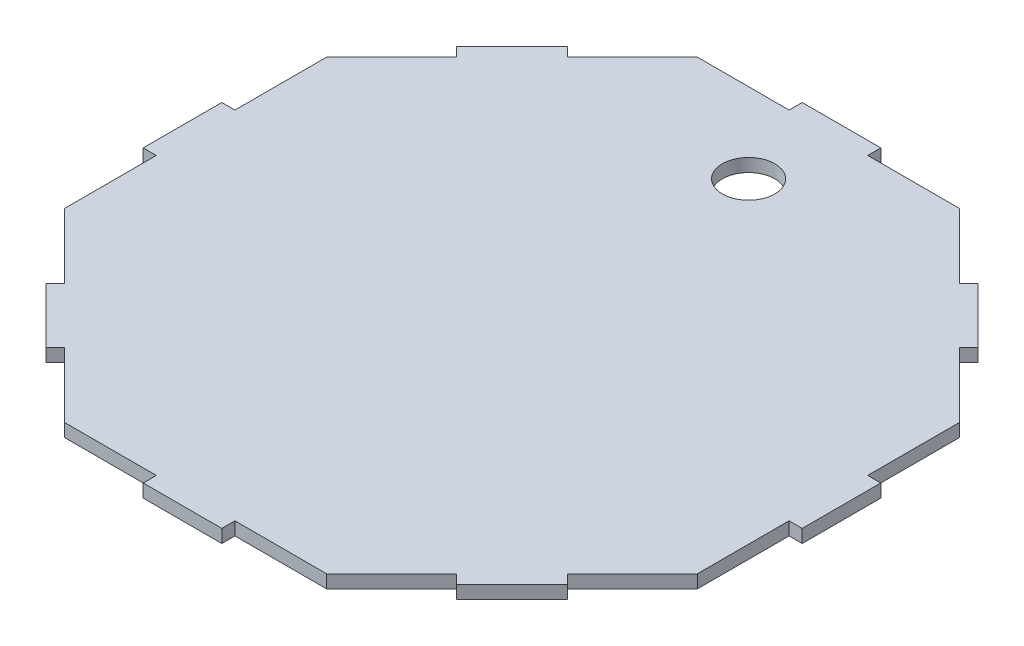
ISO-10303-21;
HEADER;
FILE_DESCRIPTION(('STEP AP214'),'2;1');
FILE_NAME('part.step','',(''),(''),'','','');
FILE_SCHEMA(('AUTOMOTIVE_DESIGN { 1 0 10303 214 1 1 1 1 }'));
ENDSEC;
DATA;
#1=APPLICATION_CONTEXT('core data for automotive mechanical design processes');
#2=APPLICATION_PROTOCOL_DEFINITION('international standard','automotive_design',2000,#1);
#3=PRODUCT_CONTEXT('',#1,'mechanical');
#4=PRODUCT('Part','Part','',(#3));
#5=PRODUCT_RELATED_PRODUCT_CATEGORY('part','',(#4));
#6=PRODUCT_DEFINITION_FORMATION('','',#4);
#7=PRODUCT_DEFINITION_CONTEXT('part definition',#1,'design');
#8=PRODUCT_DEFINITION('design','',#6,#7);
#9=PRODUCT_DEFINITION_SHAPE('','',#8);
#10=(LENGTH_UNIT() NAMED_UNIT(*) SI_UNIT(.MILLI.,.METRE.));
#11=(NAMED_UNIT(*) PLANE_ANGLE_UNIT() SI_UNIT($,.RADIAN.));
#12=(NAMED_UNIT(*) SI_UNIT($,.STERADIAN.) SOLID_ANGLE_UNIT());
#13=UNCERTAINTY_MEASURE_WITH_UNIT(LENGTH_MEASURE(1.E-05),#10,'distance_accuracy_value','');
#14=(GEOMETRIC_REPRESENTATION_CONTEXT(3) GLOBAL_UNCERTAINTY_ASSIGNED_CONTEXT((#13)) GLOBAL_UNIT_ASSIGNED_CONTEXT((#10,
#11,#12)) REPRESENTATION_CONTEXT('',''));
#15=CARTESIAN_POINT('',(0.,0.,0.));
#16=DIRECTION('',(0.,0.,1.));
#17=DIRECTION('',(1.,0.,0.));
#18=AXIS2_PLACEMENT_3D('',#15,#16,#17);
#19=CARTESIAN_POINT('',(104.801696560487,5.,8.72649424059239E-13));
#20=DIRECTION('',(1.,0.,0.));
#21=DIRECTION('',(0.,0.,-1.));
#22=AXIS2_PLACEMENT_3D('',#19,#20,#21);
#23=PLANE('',#22);
#24=DIRECTION('',(0.,0.,1.));
#25=VECTOR('',#24,1.);
#26=CARTESIAN_POINT('',(104.801696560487,0.,8.72649424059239E-13));
#27=LINE('',#26,#25);
#28=CARTESIAN_POINT('',(104.801696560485,0.,156.372402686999));
#29=VERTEX_POINT('',#28);
#30=CARTESIAN_POINT('',(104.801696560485,0.,161.372402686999));
#31=VERTEX_POINT('',#30);
#32=EDGE_CURVE('E324',#29,#31,#27,.T.);
#33=ORIENTED_EDGE('',*,*,#32,.F.);
#34=DIRECTION('',(0.,-1.,0.));
#35=VECTOR('',#34,1.);
#36=CARTESIAN_POINT('',(104.801696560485,5.,156.372402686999));
#37=LINE('',#36,#35);
#38=CARTESIAN_POINT('',(104.801696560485,5.,156.372402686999));
#39=VERTEX_POINT('',#38);
#40=EDGE_CURVE('E11',#39,#29,#37,.T.);
#41=ORIENTED_EDGE('',*,*,#40,.F.);
#42=DIRECTION('',(0.,0.,1.));
#43=VECTOR('',#42,1.);
#44=CARTESIAN_POINT('',(104.801696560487,5.,8.72649424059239E-13));
#45=LINE('',#44,#43);
#46=CARTESIAN_POINT('',(104.801696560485,5.,161.372402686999));
#47=VERTEX_POINT('',#46);
#48=EDGE_CURVE('E538',#39,#47,#45,.T.);
#49=ORIENTED_EDGE('',*,*,#48,.T.);
#50=DIRECTION('',(0.,-1.,0.));
#51=VECTOR('',#50,1.);
#52=CARTESIAN_POINT('',(104.801696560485,5.,161.372402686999));
#53=LINE('',#52,#51);
#54=EDGE_CURVE('E52',#47,#31,#53,.T.);
#55=ORIENTED_EDGE('',*,*,#54,.T.);
#56=EDGE_LOOP('',(#33,#41,#49,#55));
#57=FACE_BOUND('',#56,.T.);
#58=ADVANCED_FACE('F35',(#57),#23,.T.);
#59=CARTESIAN_POINT('',(7.44035322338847E-13,5.,156.372402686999));
#60=DIRECTION('',(0.,0.,1.));
#61=DIRECTION('',(1.,0.,0.));
#62=AXIS2_PLACEMENT_3D('',#59,#60,#61);
#63=PLANE('',#62);
#64=DIRECTION('',(-1.,0.,0.));
#65=VECTOR('',#64,1.);
#66=CARTESIAN_POINT('',(7.44035322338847E-13,0.,156.372402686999));
#67=LINE('',#66,#65);
#68=CARTESIAN_POINT('',(139.801696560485,0.,156.372402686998));
#69=VERTEX_POINT('',#68);
#70=EDGE_CURVE('E326',#69,#29,#67,.T.);
#71=ORIENTED_EDGE('',*,*,#70,.F.);
#72=DIRECTION('',(0.,-1.,0.));
#73=VECTOR('',#72,1.);
#74=CARTESIAN_POINT('',(139.801696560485,5.,156.372402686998));
#75=LINE('',#74,#73);
#76=CARTESIAN_POINT('',(139.801696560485,5.,156.372402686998));
#77=VERTEX_POINT('',#76);
#78=EDGE_CURVE('E44',#77,#69,#75,.T.);
#79=ORIENTED_EDGE('',*,*,#78,.F.);
#80=DIRECTION('',(-1.,0.,0.));
#81=VECTOR('',#80,1.);
#82=CARTESIAN_POINT('',(7.44035322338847E-13,5.,156.372402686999));
#83=LINE('',#82,#81);
#84=EDGE_CURVE('E536',#77,#39,#83,.T.);
#85=ORIENTED_EDGE('',*,*,#84,.T.);
#86=ORIENTED_EDGE('',*,*,#40,.T.);
#87=EDGE_LOOP('',(#71,#79,#85,#86));
#88=FACE_BOUND('',#87,.T.);
#89=ADVANCED_FACE('F521',(#88),#63,.T.);
#90=CARTESIAN_POINT('',(148.087049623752,5.,148.087049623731));
#91=DIRECTION('',(0.707106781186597,0.,0.707106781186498));
#92=DIRECTION('',(0.707106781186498,0.,-0.707106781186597));
#93=AXIS2_PLACEMENT_3D('',#90,#91,#92);
#94=PLANE('',#93);
#95=DIRECTION('',(-0.707106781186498,0.,0.707106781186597));
#96=VECTOR('',#95,1.);
#97=CARTESIAN_POINT('',(148.087049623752,0.,148.087049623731));
#98=LINE('',#97,#96);
#99=CARTESIAN_POINT('',(164.550433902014,0.,131.623665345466));
#100=VERTEX_POINT('',#99);
#101=EDGE_CURVE('E329',#100,#69,#98,.T.);
#102=ORIENTED_EDGE('',*,*,#101,.F.);
#103=DIRECTION('',(0.,-1.,0.));
#104=VECTOR('',#103,1.);
#105=CARTESIAN_POINT('',(164.550433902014,5.,131.623665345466));
#106=LINE('',#105,#104);
#107=CARTESIAN_POINT('',(164.550433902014,5.,131.623665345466));
#108=VERTEX_POINT('',#107);
#109=EDGE_CURVE('E510',#108,#100,#106,.T.);
#110=ORIENTED_EDGE('',*,*,#109,.F.);
#111=DIRECTION('',(-0.707106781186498,0.,0.707106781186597));
#112=VECTOR('',#111,1.);
#113=CARTESIAN_POINT('',(148.087049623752,5.,148.087049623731));
#114=LINE('',#113,#112);
#115=EDGE_CURVE('E517',#108,#77,#114,.T.);
#116=ORIENTED_EDGE('',*,*,#115,.T.);
#117=ORIENTED_EDGE('',*,*,#78,.T.);
#118=EDGE_LOOP('',(#102,#110,#116,#117));
#119=FACE_BOUND('',#118,.T.);
#120=ADVANCED_FACE('F515',(#119),#94,.T.);
#121=CARTESIAN_POINT('',(16.46338427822,5.,-16.4633842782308));
#122=DIRECTION('',(0.707106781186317,0.,-0.707106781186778));
#123=DIRECTION('',(-0.707106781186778,0.,-0.707106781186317));
#124=AXIS2_PLACEMENT_3D('',#121,#122,#123);
#125=PLANE('',#124);
#126=DIRECTION('',(0.707106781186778,0.,0.707106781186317));
#127=VECTOR('',#126,1.);
#128=CARTESIAN_POINT('',(16.46338427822,0.,-16.4633842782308));
#129=LINE('',#128,#127);
#130=CARTESIAN_POINT('',(168.085967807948,0.,135.159199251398));
#131=VERTEX_POINT('',#130);
#132=EDGE_CURVE('E332',#100,#131,#129,.T.);
#133=ORIENTED_EDGE('',*,*,#132,.T.);
#134=DIRECTION('',(0.,-1.,0.));
#135=VECTOR('',#134,1.);
#136=CARTESIAN_POINT('',(168.085967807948,5.,135.159199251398));
#137=LINE('',#136,#135);
#138=CARTESIAN_POINT('',(168.085967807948,5.,135.159199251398));
#139=VERTEX_POINT('',#138);
#140=EDGE_CURVE('E508',#139,#131,#137,.T.);
#141=ORIENTED_EDGE('',*,*,#140,.F.);
#142=DIRECTION('',(0.707106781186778,0.,0.707106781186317));
#143=VECTOR('',#142,1.);
#144=CARTESIAN_POINT('',(16.46338427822,5.,-16.4633842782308));
#145=LINE('',#144,#143);
#146=EDGE_CURVE('E532',#108,#139,#145,.T.);
#147=ORIENTED_EDGE('',*,*,#146,.F.);
#148=ORIENTED_EDGE('',*,*,#109,.T.);
#149=EDGE_LOOP('',(#133,#141,#147,#148));
#150=FACE_BOUND('',#149,.T.);
#151=ADVANCED_FACE('F529',(#150),#125,.F.);
#152=CARTESIAN_POINT('',(151.622583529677,5.,151.622583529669));
#153=DIRECTION('',(0.707106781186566,0.,0.707106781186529));
#154=DIRECTION('',(0.707106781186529,0.,-0.707106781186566));
#155=AXIS2_PLACEMENT_3D('',#152,#153,#154);
#156=PLANE('',#155);
#157=DIRECTION('',(-0.707106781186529,0.,0.707106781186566));
#158=VECTOR('',#157,1.);
#159=CARTESIAN_POINT('',(151.622583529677,0.,151.622583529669));
#160=LINE('',#159,#158);
#161=CARTESIAN_POINT('',(189.299171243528,0.,113.945995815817));
#162=VERTEX_POINT('',#161);
#163=EDGE_CURVE('E335',#162,#131,#160,.T.);
#164=ORIENTED_EDGE('',*,*,#163,.F.);
#165=DIRECTION('',(0.,-1.,0.));
#166=VECTOR('',#165,1.);
#167=CARTESIAN_POINT('',(189.299171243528,5.,113.945995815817));
#168=LINE('',#167,#166);
#169=CARTESIAN_POINT('',(189.299171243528,5.,113.945995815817));
#170=VERTEX_POINT('',#169);
#171=EDGE_CURVE('E506',#170,#162,#168,.T.);
#172=ORIENTED_EDGE('',*,*,#171,.F.);
#173=DIRECTION('',(-0.707106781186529,0.,0.707106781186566));
#174=VECTOR('',#173,1.);
#175=CARTESIAN_POINT('',(151.622583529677,5.,151.622583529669));
#176=LINE('',#175,#174);
#177=EDGE_CURVE('E534',#170,#139,#176,.T.);
#178=ORIENTED_EDGE('',*,*,#177,.T.);
#179=ORIENTED_EDGE('',*,*,#140,.T.);
#180=EDGE_LOOP('',(#164,#172,#178,#179));
#181=FACE_BOUND('',#180,.T.);
#182=ADVANCED_FACE('F654',(#181),#156,.T.);
#183=CARTESIAN_POINT('',(37.6765877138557,5.,-37.6765877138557));
#184=DIRECTION('',(-0.707106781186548,0.,0.707106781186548));
#185=DIRECTION('',(0.707106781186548,0.,0.707106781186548));
#186=AXIS2_PLACEMENT_3D('',#183,#184,#185);
#187=PLANE('',#186);
#188=DIRECTION('',(-0.707106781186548,0.,-0.707106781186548));
#189=VECTOR('',#188,1.);
#190=CARTESIAN_POINT('',(37.6765877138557,0.,-37.6765877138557));
#191=LINE('',#190,#189);
#192=CARTESIAN_POINT('',(185.763637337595,0.,110.410461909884));
#193=VERTEX_POINT('',#192);
#194=EDGE_CURVE('E338',#162,#193,#191,.T.);
#195=ORIENTED_EDGE('',*,*,#194,.T.);
#196=DIRECTION('',(0.,-1.,0.));
#197=VECTOR('',#196,1.);
#198=CARTESIAN_POINT('',(185.763637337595,5.,110.410461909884));
#199=LINE('',#198,#197);
#200=CARTESIAN_POINT('',(185.763637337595,5.,110.410461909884));
#201=VERTEX_POINT('',#200);
#202=EDGE_CURVE('E504',#201,#193,#199,.T.);
#203=ORIENTED_EDGE('',*,*,#202,.F.);
#204=DIRECTION('',(-0.707106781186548,0.,-0.707106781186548));
#205=VECTOR('',#204,1.);
#206=CARTESIAN_POINT('',(37.6765877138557,5.,-37.6765877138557));
#207=LINE('',#206,#205);
#208=EDGE_CURVE('E543',#170,#201,#207,.T.);
#209=ORIENTED_EDGE('',*,*,#208,.F.);
#210=ORIENTED_EDGE('',*,*,#171,.T.);
#211=EDGE_LOOP('',(#195,#203,#209,#210));
#212=FACE_BOUND('',#211,.T.);
#213=ADVANCED_FACE('F657',(#212),#187,.F.);
#214=CARTESIAN_POINT('',(148.087049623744,5.,148.087049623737));
#215=DIRECTION('',(0.707106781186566,0.,0.707106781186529));
#216=DIRECTION('',(0.707106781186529,0.,-0.707106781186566));
#217=AXIS2_PLACEMENT_3D('',#214,#215,#216);
#218=PLANE('',#217);
#219=DIRECTION('',(-0.707106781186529,0.,0.707106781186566));
#220=VECTOR('',#219,1.);
#221=CARTESIAN_POINT('',(148.087049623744,0.,148.087049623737));
#222=LINE('',#221,#220);
#223=CARTESIAN_POINT('',(210.512374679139,0.,85.6617245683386));
#224=VERTEX_POINT('',#223);
#225=EDGE_CURVE('E341',#224,#193,#222,.T.);
#226=ORIENTED_EDGE('',*,*,#225,.F.);
#227=DIRECTION('',(0.,-1.,0.));
#228=VECTOR('',#227,1.);
#229=CARTESIAN_POINT('',(210.512374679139,5.,85.6617245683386));
#230=LINE('',#229,#228);
#231=CARTESIAN_POINT('',(210.512374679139,5.,85.6617245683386));
#232=VERTEX_POINT('',#231);
#233=EDGE_CURVE('E502',#232,#224,#230,.T.);
#234=ORIENTED_EDGE('',*,*,#233,.F.);
#235=DIRECTION('',(-0.707106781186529,0.,0.707106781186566));
#236=VECTOR('',#235,1.);
#237=CARTESIAN_POINT('',(148.087049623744,5.,148.087049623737));
#238=LINE('',#237,#236);
#239=EDGE_CURVE('E545',#232,#201,#238,.T.);
#240=ORIENTED_EDGE('',*,*,#239,.T.);
#241=ORIENTED_EDGE('',*,*,#202,.T.);
#242=EDGE_LOOP('',(#226,#234,#240,#241));
#243=FACE_BOUND('',#242,.T.);
#244=ADVANCED_FACE('F661',(#243),#218,.T.);
#245=CARTESIAN_POINT('',(210.51237467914,5.,2.00327730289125E-12));
#246=DIRECTION('',(1.,0.,0.));
#247=DIRECTION('',(0.,0.,-1.));
#248=AXIS2_PLACEMENT_3D('',#245,#246,#247);
#249=PLANE('',#248);
#250=DIRECTION('',(0.,0.,1.));
#251=VECTOR('',#250,1.);
#252=CARTESIAN_POINT('',(210.51237467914,0.,2.00327730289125E-12));
#253=LINE('',#252,#251);
#254=CARTESIAN_POINT('',(210.512374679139,0.,50.6617245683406));
#255=VERTEX_POINT('',#254);
#256=EDGE_CURVE('E344',#255,#224,#253,.T.);
#257=ORIENTED_EDGE('',*,*,#256,.F.);
#258=DIRECTION('',(0.,-1.,0.));
#259=VECTOR('',#258,1.);
#260=CARTESIAN_POINT('',(210.512374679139,5.,50.6617245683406));
#261=LINE('',#260,#259);
#262=CARTESIAN_POINT('',(210.512374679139,5.,50.6617245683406));
#263=VERTEX_POINT('',#262);
#264=EDGE_CURVE('E500',#263,#255,#261,.T.);
#265=ORIENTED_EDGE('',*,*,#264,.F.);
#266=DIRECTION('',(0.,0.,1.));
#267=VECTOR('',#266,1.);
#268=CARTESIAN_POINT('',(210.51237467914,5.,2.00327730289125E-12));
#269=LINE('',#268,#267);
#270=EDGE_CURVE('E548',#263,#232,#269,.T.);
#271=ORIENTED_EDGE('',*,*,#270,.T.);
#272=ORIENTED_EDGE('',*,*,#233,.T.);
#273=EDGE_LOOP('',(#257,#265,#271,#272));
#274=FACE_BOUND('',#273,.T.);
#275=ADVANCED_FACE('F665',(#274),#249,.T.);
#276=CARTESIAN_POINT('',(1.01945536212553E-11,5.,50.661724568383));
#277=DIRECTION('',(-2.01227923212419E-13,0.,-1.));
#278=DIRECTION('',(-1.,0.,2.01227923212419E-13));
#279=AXIS2_PLACEMENT_3D('',#276,#277,#278);
#280=PLANE('',#279);
#281=DIRECTION('',(1.,0.,-2.01227923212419E-13));
#282=VECTOR('',#281,1.);
#283=CARTESIAN_POINT('',(1.01945536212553E-11,0.,50.661724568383));
#284=LINE('',#283,#282);
#285=CARTESIAN_POINT('',(215.512374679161,0.,50.6617245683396));
#286=VERTEX_POINT('',#285);
#287=EDGE_CURVE('E347',#255,#286,#284,.T.);
#288=ORIENTED_EDGE('',*,*,#287,.T.);
#289=DIRECTION('',(0.,-1.,0.));
#290=VECTOR('',#289,1.);
#291=CARTESIAN_POINT('',(215.512374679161,5.,50.6617245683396));
#292=LINE('',#291,#290);
#293=CARTESIAN_POINT('',(215.512374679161,5.,50.6617245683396));
#294=VERTEX_POINT('',#293);
#295=EDGE_CURVE('E498',#294,#286,#292,.T.);
#296=ORIENTED_EDGE('',*,*,#295,.F.);
#297=DIRECTION('',(1.,0.,-2.01227923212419E-13));
#298=VECTOR('',#297,1.);
#299=CARTESIAN_POINT('',(1.01945536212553E-11,5.,50.661724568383));
#300=LINE('',#299,#298);
#301=EDGE_CURVE('E551',#263,#294,#300,.T.);
#302=ORIENTED_EDGE('',*,*,#301,.F.);
#303=ORIENTED_EDGE('',*,*,#264,.T.);
#304=EDGE_LOOP('',(#288,#296,#302,#303));
#305=FACE_BOUND('',#304,.T.);
#306=ADVANCED_FACE('F669',(#305),#280,.F.);
#307=CARTESIAN_POINT('',(215.512374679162,5.,1.99389000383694E-12));
#308=DIRECTION('',(1.,0.,0.));
#309=DIRECTION('',(0.,0.,-1.));
#310=AXIS2_PLACEMENT_3D('',#307,#308,#309);
#311=PLANE('',#310);
#312=DIRECTION('',(0.,0.,1.));
#313=VECTOR('',#312,1.);
#314=CARTESIAN_POINT('',(215.512374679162,0.,1.99389000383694E-12));
#315=LINE('',#314,#313);
#316=CARTESIAN_POINT('',(215.512374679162,0.,20.6617245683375));
#317=VERTEX_POINT('',#316);
#318=EDGE_CURVE('E350',#317,#286,#315,.T.);
#319=ORIENTED_EDGE('',*,*,#318,.F.);
#320=DIRECTION('',(0.,-1.,0.));
#321=VECTOR('',#320,1.);
#322=CARTESIAN_POINT('',(215.512374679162,5.,20.6617245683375));
#323=LINE('',#322,#321);
#324=CARTESIAN_POINT('',(215.512374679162,5.,20.6617245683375));
#325=VERTEX_POINT('',#324);
#326=EDGE_CURVE('E496',#325,#317,#323,.T.);
#327=ORIENTED_EDGE('',*,*,#326,.F.);
#328=DIRECTION('',(0.,0.,1.));
#329=VECTOR('',#328,1.);
#330=CARTESIAN_POINT('',(215.512374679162,5.,1.99389000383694E-12));
#331=LINE('',#330,#329);
#332=EDGE_CURVE('E553',#325,#294,#331,.T.);
#333=ORIENTED_EDGE('',*,*,#332,.T.);
#334=ORIENTED_EDGE('',*,*,#295,.T.);
#335=EDGE_LOOP('',(#319,#327,#333,#334));
#336=FACE_BOUND('',#335,.T.);
#337=ADVANCED_FACE('F673',(#336),#311,.T.);
#338=CARTESIAN_POINT('',(4.18638982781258E-12,5.,20.6617245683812));
#339=DIRECTION('',(-2.02615701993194E-13,0.,-1.));
#340=DIRECTION('',(-1.,0.,2.02615701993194E-13));
#341=AXIS2_PLACEMENT_3D('',#338,#339,#340);
#342=PLANE('',#341);
#343=DIRECTION('',(1.,0.,-2.02615701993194E-13));
#344=VECTOR('',#343,1.);
#345=CARTESIAN_POINT('',(4.18638982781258E-12,0.,20.6617245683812));
#346=LINE('',#345,#344);
#347=CARTESIAN_POINT('',(210.51237467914,0.,20.6617245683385));
#348=VERTEX_POINT('',#347);
#349=EDGE_CURVE('E353',#348,#317,#346,.T.);
#350=ORIENTED_EDGE('',*,*,#349,.F.);
#351=DIRECTION('',(0.,-1.,0.));
#352=VECTOR('',#351,1.);
#353=CARTESIAN_POINT('',(210.51237467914,5.,20.6617245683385));
#354=LINE('',#353,#352);
#355=CARTESIAN_POINT('',(210.51237467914,5.,20.6617245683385));
#356=VERTEX_POINT('',#355);
#357=EDGE_CURVE('E494',#356,#348,#354,.T.);
#358=ORIENTED_EDGE('',*,*,#357,.F.);
#359=DIRECTION('',(1.,0.,-2.02615701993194E-13));
#360=VECTOR('',#359,1.);
#361=CARTESIAN_POINT('',(4.18638982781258E-12,5.,20.6617245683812));
#362=LINE('',#361,#360);
#363=EDGE_CURVE('E556',#356,#325,#362,.T.);
#364=ORIENTED_EDGE('',*,*,#363,.T.);
#365=ORIENTED_EDGE('',*,*,#326,.T.);
#366=EDGE_LOOP('',(#350,#358,#364,#365));
#367=FACE_BOUND('',#366,.T.);
#368=ADVANCED_FACE('F677',(#367),#342,.T.);
#369=CARTESIAN_POINT('',(210.51237467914,5.,8.68086831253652E-12));
#370=DIRECTION('',(1.,0.,0.));
#371=DIRECTION('',(0.,0.,-1.));
#372=AXIS2_PLACEMENT_3D('',#369,#370,#371);
#373=PLANE('',#372);
#374=DIRECTION('',(0.,0.,1.));
#375=VECTOR('',#374,1.);
#376=CARTESIAN_POINT('',(210.51237467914,0.,8.68086831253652E-12));
#377=LINE('',#376,#375);
#378=CARTESIAN_POINT('',(210.512374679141,0.,-14.3382754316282));
#379=VERTEX_POINT('',#378);
#380=EDGE_CURVE('E356',#379,#348,#377,.T.);
#381=ORIENTED_EDGE('',*,*,#380,.F.);
#382=DIRECTION('',(0.,-1.,0.));
#383=VECTOR('',#382,1.);
#384=CARTESIAN_POINT('',(210.512374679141,5.,-14.3382754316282));
#385=LINE('',#384,#383);
#386=CARTESIAN_POINT('',(210.512374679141,5.,-14.3382754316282));
#387=VERTEX_POINT('',#386);
#388=EDGE_CURVE('E492',#387,#379,#385,.T.);
#389=ORIENTED_EDGE('',*,*,#388,.F.);
#390=DIRECTION('',(0.,0.,1.));
#391=VECTOR('',#390,1.);
#392=CARTESIAN_POINT('',(210.51237467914,5.,8.68086831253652E-12));
#393=LINE('',#392,#391);
#394=EDGE_CURVE('E559',#387,#356,#393,.T.);
#395=ORIENTED_EDGE('',*,*,#394,.T.);
#396=ORIENTED_EDGE('',*,*,#357,.T.);
#397=EDGE_LOOP('',(#381,#389,#395,#396));
#398=FACE_BOUND('',#397,.T.);
#399=ADVANCED_FACE('F681',(#398),#373,.T.);
#400=CARTESIAN_POINT('',(112.425325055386,5.,-112.425325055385));
#401=DIRECTION('',(0.707106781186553,0.,-0.707106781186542));
#402=DIRECTION('',(-0.707106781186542,0.,-0.707106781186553));
#403=AXIS2_PLACEMENT_3D('',#400,#401,#402);
#404=PLANE('',#403);
#405=DIRECTION('',(0.707106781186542,0.,0.707106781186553));
#406=VECTOR('',#405,1.);
#407=CARTESIAN_POINT('',(112.425325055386,0.,-112.425325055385));
#408=LINE('',#407,#406);
#409=CARTESIAN_POINT('',(185.763637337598,0.,-39.0870127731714));
#410=VERTEX_POINT('',#409);
#411=EDGE_CURVE('E359',#410,#379,#408,.T.);
#412=ORIENTED_EDGE('',*,*,#411,.F.);
#413=DIRECTION('',(0.,-1.,0.));
#414=VECTOR('',#413,1.);
#415=CARTESIAN_POINT('',(185.763637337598,5.,-39.0870127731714));
#416=LINE('',#415,#414);
#417=CARTESIAN_POINT('',(185.763637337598,5.,-39.0870127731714));
#418=VERTEX_POINT('',#417);
#419=EDGE_CURVE('E490',#418,#410,#416,.T.);
#420=ORIENTED_EDGE('',*,*,#419,.F.);
#421=DIRECTION('',(0.707106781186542,0.,0.707106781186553));
#422=VECTOR('',#421,1.);
#423=CARTESIAN_POINT('',(112.425325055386,5.,-112.425325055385));
#424=LINE('',#423,#422);
#425=EDGE_CURVE('E562',#418,#387,#424,.T.);
#426=ORIENTED_EDGE('',*,*,#425,.T.);
#427=ORIENTED_EDGE('',*,*,#388,.T.);
#428=EDGE_LOOP('',(#412,#420,#426,#427));
#429=FACE_BOUND('',#428,.T.);
#430=ADVANCED_FACE('F685',(#429),#404,.T.);
#431=CARTESIAN_POINT('',(73.3383122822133,5.,73.3383122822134));
#432=DIRECTION('',(0.707106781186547,0.,0.707106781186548));
#433=DIRECTION('',(0.707106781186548,0.,-0.707106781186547));
#434=AXIS2_PLACEMENT_3D('',#431,#432,#433);
#435=PLANE('',#434);
#436=DIRECTION('',(-0.707106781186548,0.,0.707106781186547));
#437=VECTOR('',#436,1.);
#438=CARTESIAN_POINT('',(73.3383122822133,0.,73.3383122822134));
#439=LINE('',#438,#437);
#440=CARTESIAN_POINT('',(189.299171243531,0.,-42.6225466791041));
#441=VERTEX_POINT('',#440);
#442=EDGE_CURVE('E362',#441,#410,#439,.T.);
#443=ORIENTED_EDGE('',*,*,#442,.F.);
#444=DIRECTION('',(0.,-1.,0.));
#445=VECTOR('',#444,1.);
#446=CARTESIAN_POINT('',(189.299171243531,5.,-42.6225466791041));
#447=LINE('',#446,#445);
#448=CARTESIAN_POINT('',(189.299171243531,5.,-42.6225466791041));
#449=VERTEX_POINT('',#448);
#450=EDGE_CURVE('E488',#449,#441,#447,.T.);
#451=ORIENTED_EDGE('',*,*,#450,.F.);
#452=DIRECTION('',(-0.707106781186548,0.,0.707106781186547));
#453=VECTOR('',#452,1.);
#454=CARTESIAN_POINT('',(73.3383122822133,5.,73.3383122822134));
#455=LINE('',#454,#453);
#456=EDGE_CURVE('E565',#449,#418,#455,.T.);
#457=ORIENTED_EDGE('',*,*,#456,.T.);
#458=ORIENTED_EDGE('',*,*,#419,.T.);
#459=EDGE_LOOP('',(#443,#451,#457,#458));
#460=FACE_BOUND('',#459,.T.);
#461=ADVANCED_FACE('F689',(#460),#435,.T.);
#462=CARTESIAN_POINT('',(115.960858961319,5.,-115.960858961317));
#463=DIRECTION('',(0.707106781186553,0.,-0.707106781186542));
#464=DIRECTION('',(-0.707106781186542,0.,-0.707106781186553));
#465=AXIS2_PLACEMENT_3D('',#462,#463,#464);
#466=PLANE('',#465);
#467=DIRECTION('',(0.707106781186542,0.,0.707106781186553));
#468=VECTOR('',#467,1.);
#469=CARTESIAN_POINT('',(115.960858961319,0.,-115.960858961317));
#470=LINE('',#469,#468);
#471=CARTESIAN_POINT('',(168.085967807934,0.,-63.8357501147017));
#472=VERTEX_POINT('',#471);
#473=EDGE_CURVE('E365',#472,#441,#470,.T.);
#474=ORIENTED_EDGE('',*,*,#473,.F.);
#475=DIRECTION('',(0.,-1.,0.));
#476=VECTOR('',#475,1.);
#477=CARTESIAN_POINT('',(168.085967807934,5.,-63.8357501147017));
#478=LINE('',#477,#476);
#479=CARTESIAN_POINT('',(168.085967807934,5.,-63.8357501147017));
#480=VERTEX_POINT('',#479);
#481=EDGE_CURVE('E486',#480,#472,#478,.T.);
#482=ORIENTED_EDGE('',*,*,#481,.F.);
#483=DIRECTION('',(0.707106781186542,0.,0.707106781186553));
#484=VECTOR('',#483,1.);
#485=CARTESIAN_POINT('',(115.960858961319,5.,-115.960858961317));
#486=LINE('',#485,#484);
#487=EDGE_CURVE('E568',#480,#449,#486,.T.);
#488=ORIENTED_EDGE('',*,*,#487,.T.);
#489=ORIENTED_EDGE('',*,*,#450,.T.);
#490=EDGE_LOOP('',(#474,#482,#488,#489));
#491=FACE_BOUND('',#490,.T.);
#492=ADVANCED_FACE('F693',(#491),#466,.T.);
#493=CARTESIAN_POINT('',(52.1251088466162,5.,52.1251088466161));
#494=DIRECTION('',(0.707106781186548,0.,0.707106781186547));
#495=DIRECTION('',(0.707106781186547,0.,-0.707106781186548));
#496=AXIS2_PLACEMENT_3D('',#493,#494,#495);
#497=PLANE('',#496);
#498=DIRECTION('',(-0.707106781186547,0.,0.707106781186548));
#499=VECTOR('',#498,1.);
#500=CARTESIAN_POINT('',(52.1251088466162,0.,52.1251088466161));
#501=LINE('',#500,#499);
#502=CARTESIAN_POINT('',(164.550433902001,0.,-60.300216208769));
#503=VERTEX_POINT('',#502);
#504=EDGE_CURVE('E368',#472,#503,#501,.T.);
#505=ORIENTED_EDGE('',*,*,#504,.T.);
#506=DIRECTION('',(0.,-1.,0.));
#507=VECTOR('',#506,1.);
#508=CARTESIAN_POINT('',(164.550433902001,5.,-60.300216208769));
#509=LINE('',#508,#507);
#510=CARTESIAN_POINT('',(164.550433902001,5.,-60.300216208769));
#511=VERTEX_POINT('',#510);
#512=EDGE_CURVE('E484',#511,#503,#509,.T.);
#513=ORIENTED_EDGE('',*,*,#512,.F.);
#514=DIRECTION('',(-0.707106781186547,0.,0.707106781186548));
#515=VECTOR('',#514,1.);
#516=CARTESIAN_POINT('',(52.1251088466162,5.,52.1251088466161));
#517=LINE('',#516,#515);
#518=EDGE_CURVE('E571',#480,#511,#517,.T.);
#519=ORIENTED_EDGE('',*,*,#518,.F.);
#520=ORIENTED_EDGE('',*,*,#481,.T.);
#521=EDGE_LOOP('',(#505,#513,#519,#520));
#522=FACE_BOUND('',#521,.T.);
#523=ADVANCED_FACE('F697',(#522),#497,.F.);
#524=CARTESIAN_POINT('',(112.425325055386,5.,-112.425325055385));
#525=DIRECTION('',(0.707106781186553,0.,-0.707106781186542));
#526=DIRECTION('',(-0.707106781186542,0.,-0.707106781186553));
#527=AXIS2_PLACEMENT_3D('',#524,#525,#526);
#528=PLANE('',#527);
#529=DIRECTION('',(0.707106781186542,0.,0.707106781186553));
#530=VECTOR('',#529,1.);
#531=CARTESIAN_POINT('',(112.425325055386,0.,-112.425325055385));
#532=LINE('',#531,#530);
#533=CARTESIAN_POINT('',(139.801696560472,0.,-85.0489535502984));
#534=VERTEX_POINT('',#533);
#535=EDGE_CURVE('E371',#534,#503,#532,.T.);
#536=ORIENTED_EDGE('',*,*,#535,.F.);
#537=DIRECTION('',(0.,-1.,0.));
#538=VECTOR('',#537,1.);
#539=CARTESIAN_POINT('',(139.801696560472,5.,-85.0489535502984));
#540=LINE('',#539,#538);
#541=CARTESIAN_POINT('',(139.801696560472,5.,-85.0489535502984));
#542=VERTEX_POINT('',#541);
#543=EDGE_CURVE('E482',#542,#534,#540,.T.);
#544=ORIENTED_EDGE('',*,*,#543,.F.);
#545=DIRECTION('',(0.707106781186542,0.,0.707106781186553));
#546=VECTOR('',#545,1.);
#547=CARTESIAN_POINT('',(112.425325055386,5.,-112.425325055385));
#548=LINE('',#547,#546);
#549=EDGE_CURVE('E573',#542,#511,#548,.T.);
#550=ORIENTED_EDGE('',*,*,#549,.T.);
#551=ORIENTED_EDGE('',*,*,#512,.T.);
#552=EDGE_LOOP('',(#536,#544,#550,#551));
#553=FACE_BOUND('',#552,.T.);
#554=ADVANCED_FACE('F701',(#553),#528,.T.);
#555=CARTESIAN_POINT('',(5.05839141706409E-13,5.,-85.0489535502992));
#556=DIRECTION('',(0.,0.,-1.));
#557=DIRECTION('',(-1.,0.,0.));
#558=AXIS2_PLACEMENT_3D('',#555,#556,#557);
#559=PLANE('',#558);
#560=DIRECTION('',(1.,0.,0.));
#561=VECTOR('',#560,1.);
#562=CARTESIAN_POINT('',(5.05839141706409E-13,0.,-85.0489535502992));
#563=LINE('',#562,#561);
#564=CARTESIAN_POINT('',(104.801696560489,0.,-85.0489535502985));
#565=VERTEX_POINT('',#564);
#566=EDGE_CURVE('E374',#565,#534,#563,.T.);
#567=ORIENTED_EDGE('',*,*,#566,.F.);
#568=DIRECTION('',(0.,-1.,0.));
#569=VECTOR('',#568,1.);
#570=CARTESIAN_POINT('',(104.801696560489,5.,-85.0489535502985));
#571=LINE('',#570,#569);
#572=CARTESIAN_POINT('',(104.801696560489,5.,-85.0489535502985));
#573=VERTEX_POINT('',#572);
#574=EDGE_CURVE('E480',#573,#565,#571,.T.);
#575=ORIENTED_EDGE('',*,*,#574,.F.);
#576=DIRECTION('',(1.,0.,0.));
#577=VECTOR('',#576,1.);
#578=CARTESIAN_POINT('',(5.05839141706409E-13,5.,-85.0489535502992));
#579=LINE('',#578,#577);
#580=EDGE_CURVE('E576',#573,#542,#579,.T.);
#581=ORIENTED_EDGE('',*,*,#580,.T.);
#582=ORIENTED_EDGE('',*,*,#543,.T.);
#583=EDGE_LOOP('',(#567,#575,#581,#582));
#584=FACE_BOUND('',#583,.T.);
#585=ADVANCED_FACE('F705',(#584),#559,.T.);
#586=CARTESIAN_POINT('',(104.801696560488,5.,5.81766282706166E-13));
#587=DIRECTION('',(1.,0.,0.));
#588=DIRECTION('',(0.,0.,-1.));
#589=AXIS2_PLACEMENT_3D('',#586,#587,#588);
#590=PLANE('',#589);
#591=DIRECTION('',(0.,0.,1.));
#592=VECTOR('',#591,1.);
#593=CARTESIAN_POINT('',(104.801696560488,0.,5.81766282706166E-13));
#594=LINE('',#593,#592);
#595=CARTESIAN_POINT('',(104.801696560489,0.,-90.0489535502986));
#596=VERTEX_POINT('',#595);
#597=EDGE_CURVE('E377',#596,#565,#594,.T.);
#598=ORIENTED_EDGE('',*,*,#597,.F.);
#599=DIRECTION('',(0.,-1.,0.));
#600=VECTOR('',#599,1.);
#601=CARTESIAN_POINT('',(104.801696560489,5.,-90.0489535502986));
#602=LINE('',#601,#600);
#603=CARTESIAN_POINT('',(104.801696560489,5.,-90.0489535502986));
#604=VERTEX_POINT('',#603);
#605=EDGE_CURVE('E478',#604,#596,#602,.T.);
#606=ORIENTED_EDGE('',*,*,#605,.F.);
#607=DIRECTION('',(0.,0.,1.));
#608=VECTOR('',#607,1.);
#609=CARTESIAN_POINT('',(104.801696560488,5.,5.81766282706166E-13));
#610=LINE('',#609,#608);
#611=EDGE_CURVE('E579',#604,#573,#610,.T.);
#612=ORIENTED_EDGE('',*,*,#611,.T.);
#613=ORIENTED_EDGE('',*,*,#574,.T.);
#614=EDGE_LOOP('',(#598,#606,#612,#613));
#615=FACE_BOUND('',#614,.T.);
#616=ADVANCED_FACE('F709',(#615),#590,.T.);
#617=CARTESIAN_POINT('',(4.58216098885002E-13,5.,-90.0489535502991));
#618=DIRECTION('',(0.,0.,-1.));
#619=DIRECTION('',(-1.,0.,0.));
#620=AXIS2_PLACEMENT_3D('',#617,#618,#619);
#621=PLANE('',#620);
#622=DIRECTION('',(1.,0.,0.));
#623=VECTOR('',#622,1.);
#624=CARTESIAN_POINT('',(4.58216098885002E-13,0.,-90.0489535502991));
#625=LINE('',#624,#623);
#626=CARTESIAN_POINT('',(74.8016965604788,0.,-90.0489535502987));
#627=VERTEX_POINT('',#626);
#628=EDGE_CURVE('E380',#627,#596,#625,.T.);
#629=ORIENTED_EDGE('',*,*,#628,.F.);
#630=DIRECTION('',(0.,-1.,0.));
#631=VECTOR('',#630,1.);
#632=CARTESIAN_POINT('',(74.8016965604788,5.,-90.0489535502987));
#633=LINE('',#632,#631);
#634=CARTESIAN_POINT('',(74.8016965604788,5.,-90.0489535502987));
#635=VERTEX_POINT('',#634);
#636=EDGE_CURVE('E476',#635,#627,#633,.T.);
#637=ORIENTED_EDGE('',*,*,#636,.F.);
#638=DIRECTION('',(1.,0.,0.));
#639=VECTOR('',#638,1.);
#640=CARTESIAN_POINT('',(4.58216098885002E-13,5.,-90.0489535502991));
#641=LINE('',#640,#639);
#642=EDGE_CURVE('E582',#635,#604,#641,.T.);
#643=ORIENTED_EDGE('',*,*,#642,.T.);
#644=ORIENTED_EDGE('',*,*,#605,.T.);
#645=EDGE_LOOP('',(#629,#637,#643,#644));
#646=FACE_BOUND('',#645,.T.);
#647=ADVANCED_FACE('F713',(#646),#621,.T.);
#648=CARTESIAN_POINT('',(74.801696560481,5.,-1.86854773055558E-12));
#649=DIRECTION('',(-1.,0.,0.));
#650=DIRECTION('',(0.,0.,1.));
#651=AXIS2_PLACEMENT_3D('',#648,#649,#650);
#652=PLANE('',#651);
#653=DIRECTION('',(0.,0.,-1.));
#654=VECTOR('',#653,1.);
#655=CARTESIAN_POINT('',(74.801696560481,0.,-1.86854773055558E-12));
#656=LINE('',#655,#654);
#657=CARTESIAN_POINT('',(74.8016965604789,0.,-85.0489535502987));
#658=VERTEX_POINT('',#657);
#659=EDGE_CURVE('E383',#658,#627,#656,.T.);
#660=ORIENTED_EDGE('',*,*,#659,.F.);
#661=DIRECTION('',(0.,-1.,0.));
#662=VECTOR('',#661,1.);
#663=CARTESIAN_POINT('',(74.8016965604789,5.,-85.0489535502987));
#664=LINE('',#663,#662);
#665=CARTESIAN_POINT('',(74.8016965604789,5.,-85.0489535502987));
#666=VERTEX_POINT('',#665);
#667=EDGE_CURVE('E474',#666,#658,#664,.T.);
#668=ORIENTED_EDGE('',*,*,#667,.F.);
#669=DIRECTION('',(0.,0.,-1.));
#670=VECTOR('',#669,1.);
#671=CARTESIAN_POINT('',(74.801696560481,5.,-1.86854773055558E-12));
#672=LINE('',#671,#670);
#673=EDGE_CURVE('E585',#666,#635,#672,.T.);
#674=ORIENTED_EDGE('',*,*,#673,.T.);
#675=ORIENTED_EDGE('',*,*,#636,.T.);
#676=EDGE_LOOP('',(#660,#668,#674,#675));
#677=FACE_BOUND('',#676,.T.);
#678=ADVANCED_FACE('F717',(#677),#652,.T.);
#679=CARTESIAN_POINT('',(4.38393922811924E-13,5.,-85.0489535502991));
#680=DIRECTION('',(0.,0.,-1.));
#681=DIRECTION('',(-1.,0.,0.));
#682=AXIS2_PLACEMENT_3D('',#679,#680,#681);
#683=PLANE('',#682);
#684=DIRECTION('',(1.,0.,0.));
#685=VECTOR('',#684,1.);
#686=CARTESIAN_POINT('',(4.38393922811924E-13,0.,-85.0489535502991));
#687=LINE('',#686,#685);
#688=CARTESIAN_POINT('',(39.801696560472,0.,-85.0489535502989));
#689=VERTEX_POINT('',#688);
#690=EDGE_CURVE('E386',#689,#658,#687,.T.);
#691=ORIENTED_EDGE('',*,*,#690,.F.);
#692=DIRECTION('',(0.,-1.,0.));
#693=VECTOR('',#692,1.);
#694=CARTESIAN_POINT('',(39.801696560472,5.,-85.0489535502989));
#695=LINE('',#694,#693);
#696=CARTESIAN_POINT('',(39.801696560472,5.,-85.0489535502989));
#697=VERTEX_POINT('',#696);
#698=EDGE_CURVE('E472',#697,#689,#695,.T.);
#699=ORIENTED_EDGE('',*,*,#698,.F.);
#700=DIRECTION('',(1.,0.,0.));
#701=VECTOR('',#700,1.);
#702=CARTESIAN_POINT('',(4.38393922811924E-13,5.,-85.0489535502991));
#703=LINE('',#702,#701);
#704=EDGE_CURVE('E588',#697,#666,#703,.T.);
#705=ORIENTED_EDGE('',*,*,#704,.T.);
#706=ORIENTED_EDGE('',*,*,#667,.T.);
#707=EDGE_LOOP('',(#691,#699,#705,#706));
#708=FACE_BOUND('',#707,.T.);
#709=ADVANCED_FACE('F721',(#708),#683,.T.);
#710=CARTESIAN_POINT('',(-22.6236284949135,5.,-22.6236284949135));
#711=DIRECTION('',(-0.707106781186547,0.,-0.707106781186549));
#712=DIRECTION('',(-0.707106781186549,0.,0.707106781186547));
#713=AXIS2_PLACEMENT_3D('',#710,#711,#712);
#714=PLANE('',#713);
#715=DIRECTION('',(0.707106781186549,0.,-0.707106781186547));
#716=VECTOR('',#715,1.);
#717=CARTESIAN_POINT('',(-22.6236284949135,0.,-22.6236284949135));
#718=LINE('',#717,#716);
#719=CARTESIAN_POINT('',(15.0529592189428,0.,-60.3002162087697));
#720=VERTEX_POINT('',#719);
#721=EDGE_CURVE('E389',#720,#689,#718,.T.);
#722=ORIENTED_EDGE('',*,*,#721,.F.);
#723=DIRECTION('',(0.,-1.,0.));
#724=VECTOR('',#723,1.);
#725=CARTESIAN_POINT('',(15.0529592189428,5.,-60.3002162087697));
#726=LINE('',#725,#724);
#727=CARTESIAN_POINT('',(15.0529592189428,5.,-60.3002162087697));
#728=VERTEX_POINT('',#727);
#729=EDGE_CURVE('E470',#728,#720,#726,.T.);
#730=ORIENTED_EDGE('',*,*,#729,.F.);
#731=DIRECTION('',(0.707106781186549,0.,-0.707106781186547));
#732=VECTOR('',#731,1.);
#733=CARTESIAN_POINT('',(-22.6236284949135,5.,-22.6236284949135));
#734=LINE('',#733,#732);
#735=EDGE_CURVE('E591',#728,#697,#734,.T.);
#736=ORIENTED_EDGE('',*,*,#735,.T.);
#737=ORIENTED_EDGE('',*,*,#698,.T.);
#738=EDGE_LOOP('',(#722,#730,#736,#737));
#739=FACE_BOUND('',#738,.T.);
#740=ADVANCED_FACE('F725',(#739),#714,.T.);
#741=CARTESIAN_POINT('',(37.6765877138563,5.,-37.676587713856));
#742=DIRECTION('',(-0.70710678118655,0.,0.707106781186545));
#743=DIRECTION('',(0.707106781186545,0.,0.70710678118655));
#744=AXIS2_PLACEMENT_3D('',#741,#742,#743);
#745=PLANE('',#744);
#746=DIRECTION('',(-0.707106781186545,0.,-0.70710678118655));
#747=VECTOR('',#746,1.);
#748=CARTESIAN_POINT('',(37.6765877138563,0.,-37.676587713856));
#749=LINE('',#748,#747);
#750=CARTESIAN_POINT('',(11.5174253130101,0.,-63.8357501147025));
#751=VERTEX_POINT('',#750);
#752=EDGE_CURVE('E392',#720,#751,#749,.T.);
#753=ORIENTED_EDGE('',*,*,#752,.T.);
#754=DIRECTION('',(0.,-1.,0.));
#755=VECTOR('',#754,1.);
#756=CARTESIAN_POINT('',(11.5174253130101,5.,-63.8357501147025));
#757=LINE('',#756,#755);
#758=CARTESIAN_POINT('',(11.5174253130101,5.,-63.8357501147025));
#759=VERTEX_POINT('',#758);
#760=EDGE_CURVE('E468',#759,#751,#757,.T.);
#761=ORIENTED_EDGE('',*,*,#760,.F.);
#762=DIRECTION('',(-0.707106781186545,0.,-0.70710678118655));
#763=VECTOR('',#762,1.);
#764=CARTESIAN_POINT('',(37.6765877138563,5.,-37.676587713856));
#765=LINE('',#764,#763);
#766=EDGE_CURVE('E594',#728,#759,#765,.T.);
#767=ORIENTED_EDGE('',*,*,#766,.F.);
#768=ORIENTED_EDGE('',*,*,#729,.T.);
#769=EDGE_LOOP('',(#753,#761,#767,#768));
#770=FACE_BOUND('',#769,.T.);
#771=ADVANCED_FACE('F729',(#770),#745,.F.);
#772=CARTESIAN_POINT('',(-26.1591624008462,5.,-26.1591624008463));
#773=DIRECTION('',(-0.707106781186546,0.,-0.707106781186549));
#774=DIRECTION('',(-0.707106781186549,0.,0.707106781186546));
#775=AXIS2_PLACEMENT_3D('',#772,#773,#774);
#776=PLANE('',#775);
#777=DIRECTION('',(0.707106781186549,0.,-0.707106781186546));
#778=VECTOR('',#777,1.);
#779=CARTESIAN_POINT('',(-26.1591624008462,0.,-26.1591624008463));
#780=LINE('',#779,#778);
#781=CARTESIAN_POINT('',(-9.69577812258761,0.,-42.6225466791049));
#782=VERTEX_POINT('',#781);
#783=EDGE_CURVE('E395',#782,#751,#780,.T.);
#784=ORIENTED_EDGE('',*,*,#783,.F.);
#785=DIRECTION('',(0.,-1.,0.));
#786=VECTOR('',#785,1.);
#787=CARTESIAN_POINT('',(-9.69577812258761,5.,-42.6225466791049));
#788=LINE('',#787,#786);
#789=CARTESIAN_POINT('',(-9.69577812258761,5.,-42.6225466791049));
#790=VERTEX_POINT('',#789);
#791=EDGE_CURVE('E466',#790,#782,#788,.T.);
#792=ORIENTED_EDGE('',*,*,#791,.F.);
#793=DIRECTION('',(0.707106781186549,0.,-0.707106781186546));
#794=VECTOR('',#793,1.);
#795=CARTESIAN_POINT('',(-26.1591624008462,5.,-26.1591624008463));
#796=LINE('',#795,#794);
#797=EDGE_CURVE('E596',#790,#759,#796,.T.);
#798=ORIENTED_EDGE('',*,*,#797,.T.);
#799=ORIENTED_EDGE('',*,*,#760,.T.);
#800=EDGE_LOOP('',(#784,#792,#798,#799));
#801=FACE_BOUND('',#800,.T.);
#802=ADVANCED_FACE('F733',(#801),#776,.T.);
#803=CARTESIAN_POINT('',(16.4633842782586,5.,-16.4633842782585));
#804=DIRECTION('',(0.70710678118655,0.,-0.707106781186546));
#805=DIRECTION('',(-0.707106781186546,0.,-0.70710678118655));
#806=AXIS2_PLACEMENT_3D('',#803,#804,#805);
#807=PLANE('',#806);
#808=DIRECTION('',(0.707106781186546,0.,0.70710678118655));
#809=VECTOR('',#808,1.);
#810=CARTESIAN_POINT('',(16.4633842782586,0.,-16.4633842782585));
#811=LINE('',#810,#809);
#812=CARTESIAN_POINT('',(-6.16024421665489,0.,-39.0870127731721));
#813=VERTEX_POINT('',#812);
#814=EDGE_CURVE('E398',#782,#813,#811,.T.);
#815=ORIENTED_EDGE('',*,*,#814,.T.);
#816=DIRECTION('',(0.,-1.,0.));
#817=VECTOR('',#816,1.);
#818=CARTESIAN_POINT('',(-6.16024421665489,5.,-39.0870127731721));
#819=LINE('',#818,#817);
#820=CARTESIAN_POINT('',(-6.16024421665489,5.,-39.0870127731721));
#821=VERTEX_POINT('',#820);
#822=EDGE_CURVE('E464',#821,#813,#819,.T.);
#823=ORIENTED_EDGE('',*,*,#822,.F.);
#824=DIRECTION('',(0.707106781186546,0.,0.70710678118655));
#825=VECTOR('',#824,1.);
#826=CARTESIAN_POINT('',(16.4633842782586,5.,-16.4633842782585));
#827=LINE('',#826,#825);
#828=EDGE_CURVE('E599',#790,#821,#827,.T.);
#829=ORIENTED_EDGE('',*,*,#828,.F.);
#830=ORIENTED_EDGE('',*,*,#791,.T.);
#831=EDGE_LOOP('',(#815,#823,#829,#830));
#832=FACE_BOUND('',#831,.T.);
#833=ADVANCED_FACE('F737',(#832),#807,.F.);
#834=CARTESIAN_POINT('',(-22.6236284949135,5.,-22.6236284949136));
#835=DIRECTION('',(-0.707106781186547,0.,-0.707106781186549));
#836=DIRECTION('',(-0.707106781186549,0.,0.707106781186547));
#837=AXIS2_PLACEMENT_3D('',#834,#835,#836);
#838=PLANE('',#837);
#839=DIRECTION('',(0.707106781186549,0.,-0.707106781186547));
#840=VECTOR('',#839,1.);
#841=CARTESIAN_POINT('',(-22.6236284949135,0.,-22.6236284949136));
#842=LINE('',#841,#840);
#843=CARTESIAN_POINT('',(-30.908981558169,0.,-14.3382754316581));
#844=VERTEX_POINT('',#843);
#845=EDGE_CURVE('E401',#844,#813,#842,.T.);
#846=ORIENTED_EDGE('',*,*,#845,.F.);
#847=DIRECTION('',(0.,-1.,0.));
#848=VECTOR('',#847,1.);
#849=CARTESIAN_POINT('',(-30.908981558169,5.,-14.3382754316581));
#850=LINE('',#849,#848);
#851=CARTESIAN_POINT('',(-30.908981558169,5.,-14.3382754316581));
#852=VERTEX_POINT('',#851);
#853=EDGE_CURVE('E462',#852,#844,#850,.T.);
#854=ORIENTED_EDGE('',*,*,#853,.F.);
#855=DIRECTION('',(0.707106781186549,0.,-0.707106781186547));
#856=VECTOR('',#855,1.);
#857=CARTESIAN_POINT('',(-22.6236284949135,5.,-22.6236284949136));
#858=LINE('',#857,#856);
#859=EDGE_CURVE('E601',#852,#821,#858,.T.);
#860=ORIENTED_EDGE('',*,*,#859,.T.);
#861=ORIENTED_EDGE('',*,*,#822,.T.);
#862=EDGE_LOOP('',(#846,#854,#860,#861));
#863=FACE_BOUND('',#862,.T.);
#864=ADVANCED_FACE('F741',(#863),#838,.T.);
#865=CARTESIAN_POINT('',(-30.9089815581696,5.,-1.33893144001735E-12));
#866=DIRECTION('',(-1.,0.,0.));
#867=DIRECTION('',(0.,0.,1.));
#868=AXIS2_PLACEMENT_3D('',#865,#866,#867);
#869=PLANE('',#868);
#870=DIRECTION('',(0.,0.,-1.));
#871=VECTOR('',#870,1.);
#872=CARTESIAN_POINT('',(-30.9089815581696,0.,-1.33893144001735E-12));
#873=LINE('',#872,#871);
#874=CARTESIAN_POINT('',(-30.9089815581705,0.,20.6617245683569));
#875=VERTEX_POINT('',#874);
#876=EDGE_CURVE('E404',#875,#844,#873,.T.);
#877=ORIENTED_EDGE('',*,*,#876,.F.);
#878=DIRECTION('',(0.,-1.,0.));
#879=VECTOR('',#878,1.);
#880=CARTESIAN_POINT('',(-30.9089815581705,5.,20.6617245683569));
#881=LINE('',#880,#879);
#882=CARTESIAN_POINT('',(-30.9089815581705,5.,20.6617245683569));
#883=VERTEX_POINT('',#882);
#884=EDGE_CURVE('E460',#883,#875,#881,.T.);
#885=ORIENTED_EDGE('',*,*,#884,.F.);
#886=DIRECTION('',(0.,0.,-1.));
#887=VECTOR('',#886,1.);
#888=CARTESIAN_POINT('',(-30.9089815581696,5.,-1.33893144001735E-12));
#889=LINE('',#888,#887);
#890=EDGE_CURVE('E604',#883,#852,#889,.T.);
#891=ORIENTED_EDGE('',*,*,#890,.T.);
#892=ORIENTED_EDGE('',*,*,#853,.T.);
#893=EDGE_LOOP('',(#877,#885,#891,#892));
#894=FACE_BOUND('',#893,.T.);
#895=ADVANCED_FACE('F745',(#894),#869,.T.);
#896=CARTESIAN_POINT('',(0.,5.,20.6617245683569));
#897=DIRECTION('',(0.,0.,-1.));
#898=DIRECTION('',(-1.,0.,0.));
#899=AXIS2_PLACEMENT_3D('',#896,#897,#898);
#900=PLANE('',#899);
#901=DIRECTION('',(1.,0.,0.));
#902=VECTOR('',#901,1.);
#903=CARTESIAN_POINT('',(0.,0.,20.6617245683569));
#904=LINE('',#903,#902);
#905=CARTESIAN_POINT('',(-35.9089815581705,0.,20.6617245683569));
#906=VERTEX_POINT('',#905);
#907=EDGE_CURVE('E407',#906,#875,#904,.T.);
#908=ORIENTED_EDGE('',*,*,#907,.F.);
#909=DIRECTION('',(0.,-1.,0.));
#910=VECTOR('',#909,1.);
#911=CARTESIAN_POINT('',(-35.9089815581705,5.,20.6617245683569));
#912=LINE('',#911,#910);
#913=CARTESIAN_POINT('',(-35.9089815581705,5.,20.6617245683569));
#914=VERTEX_POINT('',#913);
#915=EDGE_CURVE('E458',#914,#906,#912,.T.);
#916=ORIENTED_EDGE('',*,*,#915,.F.);
#917=DIRECTION('',(1.,0.,0.));
#918=VECTOR('',#917,1.);
#919=CARTESIAN_POINT('',(0.,5.,20.6617245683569));
#920=LINE('',#919,#918);
#921=EDGE_CURVE('E607',#914,#883,#920,.T.);
#922=ORIENTED_EDGE('',*,*,#921,.T.);
#923=ORIENTED_EDGE('',*,*,#884,.T.);
#924=EDGE_LOOP('',(#908,#916,#922,#923));
#925=FACE_BOUND('',#924,.T.);
#926=ADVANCED_FACE('F749',(#925),#900,.T.);
#927=CARTESIAN_POINT('',(-35.9089815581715,5.,1.80231963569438E-12));
#928=DIRECTION('',(-1.,0.,0.));
#929=DIRECTION('',(0.,0.,1.));
#930=AXIS2_PLACEMENT_3D('',#927,#928,#929);
#931=PLANE('',#930);
#932=DIRECTION('',(0.,0.,-1.));
#933=VECTOR('',#932,1.);
#934=CARTESIAN_POINT('',(-35.9089815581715,0.,1.80231963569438E-12));
#935=LINE('',#934,#933);
#936=CARTESIAN_POINT('',(-35.908981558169,0.,50.6617245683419));
#937=VERTEX_POINT('',#936);
#938=EDGE_CURVE('E410',#937,#906,#935,.T.);
#939=ORIENTED_EDGE('',*,*,#938,.F.);
#940=DIRECTION('',(0.,-1.,0.));
#941=VECTOR('',#940,1.);
#942=CARTESIAN_POINT('',(-35.908981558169,5.,50.6617245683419));
#943=LINE('',#942,#941);
#944=CARTESIAN_POINT('',(-35.908981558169,5.,50.6617245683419));
#945=VERTEX_POINT('',#944);
#946=EDGE_CURVE('E456',#945,#937,#943,.T.);
#947=ORIENTED_EDGE('',*,*,#946,.F.);
#948=DIRECTION('',(0.,0.,-1.));
#949=VECTOR('',#948,1.);
#950=CARTESIAN_POINT('',(-35.9089815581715,5.,1.80231963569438E-12));
#951=LINE('',#950,#949);
#952=EDGE_CURVE('E610',#945,#914,#951,.T.);
#953=ORIENTED_EDGE('',*,*,#952,.T.);
#954=ORIENTED_EDGE('',*,*,#915,.T.);
#955=EDGE_LOOP('',(#939,#947,#953,#954));
#956=FACE_BOUND('',#955,.T.);
#957=ADVANCED_FACE('F753',(#956),#931,.T.);
#958=CARTESIAN_POINT('',(0.,5.,50.6617245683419));
#959=DIRECTION('',(0.,0.,-1.));
#960=DIRECTION('',(-1.,0.,0.));
#961=AXIS2_PLACEMENT_3D('',#958,#959,#960);
#962=PLANE('',#961);
#963=DIRECTION('',(1.,0.,0.));
#964=VECTOR('',#963,1.);
#965=CARTESIAN_POINT('',(0.,0.,50.6617245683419));
#966=LINE('',#965,#964);
#967=CARTESIAN_POINT('',(-30.9089815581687,0.,50.6617245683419));
#968=VERTEX_POINT('',#967);
#969=EDGE_CURVE('E413',#937,#968,#966,.T.);
#970=ORIENTED_EDGE('',*,*,#969,.T.);
#971=DIRECTION('',(0.,-1.,0.));
#972=VECTOR('',#971,1.);
#973=CARTESIAN_POINT('',(-30.9089815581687,5.,50.6617245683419));
#974=LINE('',#973,#972);
#975=CARTESIAN_POINT('',(-30.9089815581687,5.,50.6617245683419));
#976=VERTEX_POINT('',#975);
#977=EDGE_CURVE('E454',#976,#968,#974,.T.);
#978=ORIENTED_EDGE('',*,*,#977,.F.);
#979=DIRECTION('',(1.,0.,0.));
#980=VECTOR('',#979,1.);
#981=CARTESIAN_POINT('',(0.,5.,50.6617245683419));
#982=LINE('',#981,#980);
#983=EDGE_CURVE('E613',#945,#976,#982,.T.);
#984=ORIENTED_EDGE('',*,*,#983,.F.);
#985=ORIENTED_EDGE('',*,*,#946,.T.);
#986=EDGE_LOOP('',(#970,#978,#984,#985));
#987=FACE_BOUND('',#986,.T.);
#988=ADVANCED_FACE('F757',(#987),#962,.F.);
#989=CARTESIAN_POINT('',(-30.9089815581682,5.,-2.78816386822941E-13));
#990=DIRECTION('',(-1.,0.,0.));
#991=DIRECTION('',(0.,0.,1.));
#992=AXIS2_PLACEMENT_3D('',#989,#990,#991);
#993=PLANE('',#992);
#994=DIRECTION('',(0.,0.,-1.));
#995=VECTOR('',#994,1.);
#996=CARTESIAN_POINT('',(-30.9089815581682,0.,-2.78816386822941E-13));
#997=LINE('',#996,#995);
#998=CARTESIAN_POINT('',(-30.908981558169,0.,85.661724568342));
#999=VERTEX_POINT('',#998);
#1000=EDGE_CURVE('E416',#999,#968,#997,.T.);
#1001=ORIENTED_EDGE('',*,*,#1000,.F.);
#1002=DIRECTION('',(0.,-1.,0.));
#1003=VECTOR('',#1002,1.);
#1004=CARTESIAN_POINT('',(-30.908981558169,5.,85.661724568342));
#1005=LINE('',#1004,#1003);
#1006=CARTESIAN_POINT('',(-30.908981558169,5.,85.661724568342));
#1007=VERTEX_POINT('',#1006);
#1008=EDGE_CURVE('E452',#1007,#999,#1005,.T.);
#1009=ORIENTED_EDGE('',*,*,#1008,.F.);
#1010=DIRECTION('',(0.,0.,-1.));
#1011=VECTOR('',#1010,1.);
#1012=CARTESIAN_POINT('',(-30.9089815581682,5.,-2.78816386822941E-13));
#1013=LINE('',#1012,#1011);
#1014=EDGE_CURVE('E615',#1007,#976,#1013,.T.);
#1015=ORIENTED_EDGE('',*,*,#1014,.T.);
#1016=ORIENTED_EDGE('',*,*,#977,.T.);
#1017=EDGE_LOOP('',(#1001,#1009,#1015,#1016));
#1018=FACE_BOUND('',#1017,.T.);
#1019=ADVANCED_FACE('F761',(#1018),#993,.T.);
#1020=CARTESIAN_POINT('',(-58.2853530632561,5.,58.2853530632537));
#1021=DIRECTION('',(-0.707106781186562,0.,0.707106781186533));
#1022=DIRECTION('',(0.707106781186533,0.,0.707106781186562));
#1023=AXIS2_PLACEMENT_3D('',#1020,#1021,#1022);
#1024=PLANE('',#1023);
#1025=DIRECTION('',(-0.707106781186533,0.,-0.707106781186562));
#1026=VECTOR('',#1025,1.);
#1027=CARTESIAN_POINT('',(-58.2853530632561,0.,58.2853530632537));
#1028=LINE('',#1027,#1026);
#1029=CARTESIAN_POINT('',(-6.16024421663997,0.,110.410461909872));
#1030=VERTEX_POINT('',#1029);
#1031=EDGE_CURVE('E419',#1030,#999,#1028,.T.);
#1032=ORIENTED_EDGE('',*,*,#1031,.F.);
#1033=DIRECTION('',(0.,-1.,0.));
#1034=VECTOR('',#1033,1.);
#1035=CARTESIAN_POINT('',(-6.16024421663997,5.,110.410461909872));
#1036=LINE('',#1035,#1034);
#1037=CARTESIAN_POINT('',(-6.16024421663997,5.,110.410461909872));
#1038=VERTEX_POINT('',#1037);
#1039=EDGE_CURVE('E450',#1038,#1030,#1036,.T.);
#1040=ORIENTED_EDGE('',*,*,#1039,.F.);
#1041=DIRECTION('',(-0.707106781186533,0.,-0.707106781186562));
#1042=VECTOR('',#1041,1.);
#1043=CARTESIAN_POINT('',(-58.2853530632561,5.,58.2853530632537));
#1044=LINE('',#1043,#1042);
#1045=EDGE_CURVE('E618',#1038,#1007,#1044,.T.);
#1046=ORIENTED_EDGE('',*,*,#1045,.T.);
#1047=ORIENTED_EDGE('',*,*,#1008,.T.);
#1048=EDGE_LOOP('',(#1032,#1040,#1046,#1047));
#1049=FACE_BOUND('',#1048,.T.);
#1050=ADVANCED_FACE('F765',(#1049),#1024,.T.);
#1051=CARTESIAN_POINT('',(52.125108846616,5.,52.1251088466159));
#1052=DIRECTION('',(0.707106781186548,0.,0.707106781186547));
#1053=DIRECTION('',(0.707106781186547,0.,-0.707106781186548));
#1054=AXIS2_PLACEMENT_3D('',#1051,#1052,#1053);
#1055=PLANE('',#1054);
#1056=DIRECTION('',(-0.707106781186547,0.,0.707106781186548));
#1057=VECTOR('',#1056,1.);
#1058=CARTESIAN_POINT('',(52.125108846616,0.,52.1251088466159));
#1059=LINE('',#1058,#1057);
#1060=CARTESIAN_POINT('',(-9.69577812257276,0.,113.945995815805));
#1061=VERTEX_POINT('',#1060);
#1062=EDGE_CURVE('E422',#1030,#1061,#1059,.T.);
#1063=ORIENTED_EDGE('',*,*,#1062,.T.);
#1064=DIRECTION('',(0.,-1.,0.));
#1065=VECTOR('',#1064,1.);
#1066=CARTESIAN_POINT('',(-9.69577812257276,5.,113.945995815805));
#1067=LINE('',#1066,#1065);
#1068=CARTESIAN_POINT('',(-9.69577812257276,5.,113.945995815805));
#1069=VERTEX_POINT('',#1068);
#1070=EDGE_CURVE('E448',#1069,#1061,#1067,.T.);
#1071=ORIENTED_EDGE('',*,*,#1070,.F.);
#1072=DIRECTION('',(-0.707106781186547,0.,0.707106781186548));
#1073=VECTOR('',#1072,1.);
#1074=CARTESIAN_POINT('',(52.125108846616,5.,52.1251088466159));
#1075=LINE('',#1074,#1073);
#1076=EDGE_CURVE('E621',#1038,#1069,#1075,.T.);
#1077=ORIENTED_EDGE('',*,*,#1076,.F.);
#1078=ORIENTED_EDGE('',*,*,#1039,.T.);
#1079=EDGE_LOOP('',(#1063,#1071,#1077,#1078));
#1080=FACE_BOUND('',#1079,.T.);
#1081=ADVANCED_FACE('F769',(#1080),#1055,.F.);
#1082=CARTESIAN_POINT('',(-61.820886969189,5.,61.8208869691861));
#1083=DIRECTION('',(-0.707106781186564,0.,0.707106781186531));
#1084=DIRECTION('',(0.707106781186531,0.,0.707106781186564));
#1085=AXIS2_PLACEMENT_3D('',#1082,#1083,#1084);
#1086=PLANE('',#1085);
#1087=DIRECTION('',(-0.707106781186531,0.,-0.707106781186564));
#1088=VECTOR('',#1087,1.);
#1089=CARTESIAN_POINT('',(-61.820886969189,0.,61.8208869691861));
#1090=LINE('',#1089,#1088);
#1091=CARTESIAN_POINT('',(11.5174253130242,0.,135.159199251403));
#1092=VERTEX_POINT('',#1091);
#1093=EDGE_CURVE('E425',#1092,#1061,#1090,.T.);
#1094=ORIENTED_EDGE('',*,*,#1093,.F.);
#1095=DIRECTION('',(0.,-1.,0.));
#1096=VECTOR('',#1095,1.);
#1097=CARTESIAN_POINT('',(11.5174253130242,5.,135.159199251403));
#1098=LINE('',#1097,#1096);
#1099=CARTESIAN_POINT('',(11.5174253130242,5.,135.159199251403));
#1100=VERTEX_POINT('',#1099);
#1101=EDGE_CURVE('E446',#1100,#1092,#1098,.T.);
#1102=ORIENTED_EDGE('',*,*,#1101,.F.);
#1103=DIRECTION('',(-0.707106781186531,0.,-0.707106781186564));
#1104=VECTOR('',#1103,1.);
#1105=CARTESIAN_POINT('',(-61.820886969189,5.,61.8208869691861));
#1106=LINE('',#1105,#1104);
#1107=EDGE_CURVE('E623',#1100,#1069,#1106,.T.);
#1108=ORIENTED_EDGE('',*,*,#1107,.T.);
#1109=ORIENTED_EDGE('',*,*,#1070,.T.);
#1110=EDGE_LOOP('',(#1094,#1102,#1108,#1109));
#1111=FACE_BOUND('',#1110,.T.);
#1112=ADVANCED_FACE('F773',(#1111),#1086,.T.);
#1113=CARTESIAN_POINT('',(73.3383122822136,5.,73.338312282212));
#1114=DIRECTION('',(0.707106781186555,0.,0.70710678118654));
#1115=DIRECTION('',(0.70710678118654,0.,-0.707106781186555));
#1116=AXIS2_PLACEMENT_3D('',#1113,#1114,#1115);
#1117=PLANE('',#1116);
#1118=DIRECTION('',(-0.70710678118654,0.,0.707106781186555));
#1119=VECTOR('',#1118,1.);
#1120=CARTESIAN_POINT('',(73.3383122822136,0.,73.338312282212));
#1121=LINE('',#1120,#1119);
#1122=CARTESIAN_POINT('',(15.052959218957,0.,131.62366534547));
#1123=VERTEX_POINT('',#1122);
#1124=EDGE_CURVE('E428',#1123,#1092,#1121,.T.);
#1125=ORIENTED_EDGE('',*,*,#1124,.F.);
#1126=DIRECTION('',(0.,-1.,0.));
#1127=VECTOR('',#1126,1.);
#1128=CARTESIAN_POINT('',(15.052959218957,5.,131.62366534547));
#1129=LINE('',#1128,#1127);
#1130=CARTESIAN_POINT('',(15.052959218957,5.,131.62366534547));
#1131=VERTEX_POINT('',#1130);
#1132=EDGE_CURVE('E444',#1131,#1123,#1129,.T.);
#1133=ORIENTED_EDGE('',*,*,#1132,.F.);
#1134=DIRECTION('',(-0.70710678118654,0.,0.707106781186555));
#1135=VECTOR('',#1134,1.);
#1136=CARTESIAN_POINT('',(73.3383122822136,5.,73.338312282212));
#1137=LINE('',#1136,#1135);
#1138=EDGE_CURVE('E626',#1131,#1100,#1137,.T.);
#1139=ORIENTED_EDGE('',*,*,#1138,.T.);
#1140=ORIENTED_EDGE('',*,*,#1101,.T.);
#1141=EDGE_LOOP('',(#1125,#1133,#1139,#1140));
#1142=FACE_BOUND('',#1141,.T.);
#1143=ADVANCED_FACE('F777',(#1142),#1117,.T.);
#1144=CARTESIAN_POINT('',(-58.2853530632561,5.,58.2853530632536));
#1145=DIRECTION('',(-0.707106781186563,0.,0.707106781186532));
#1146=DIRECTION('',(0.707106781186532,0.,0.707106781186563));
#1147=AXIS2_PLACEMENT_3D('',#1144,#1145,#1146);
#1148=PLANE('',#1147);
#1149=DIRECTION('',(-0.707106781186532,0.,-0.707106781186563));
#1150=VECTOR('',#1149,1.);
#1151=CARTESIAN_POINT('',(-58.2853530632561,0.,58.2853530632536));
#1152=LINE('',#1151,#1150);
#1153=CARTESIAN_POINT('',(39.801696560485,0.,156.372402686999));
#1154=VERTEX_POINT('',#1153);
#1155=EDGE_CURVE('E431',#1154,#1123,#1152,.T.);
#1156=ORIENTED_EDGE('',*,*,#1155,.F.);
#1157=DIRECTION('',(0.,-1.,0.));
#1158=VECTOR('',#1157,1.);
#1159=CARTESIAN_POINT('',(39.801696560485,5.,156.372402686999));
#1160=LINE('',#1159,#1158);
#1161=CARTESIAN_POINT('',(39.801696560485,5.,156.372402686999));
#1162=VERTEX_POINT('',#1161);
#1163=EDGE_CURVE('E303',#1162,#1154,#1160,.T.);
#1164=ORIENTED_EDGE('',*,*,#1163,.F.);
#1165=DIRECTION('',(-0.707106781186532,0.,-0.707106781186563));
#1166=VECTOR('',#1165,1.);
#1167=CARTESIAN_POINT('',(-58.2853530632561,5.,58.2853530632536));
#1168=LINE('',#1167,#1166);
#1169=EDGE_CURVE('E313',#1162,#1131,#1168,.T.);
#1170=ORIENTED_EDGE('',*,*,#1169,.T.);
#1171=ORIENTED_EDGE('',*,*,#1132,.T.);
#1172=EDGE_LOOP('',(#1156,#1164,#1170,#1171));
#1173=FACE_BOUND('',#1172,.T.);
#1174=ADVANCED_FACE('F630',(#1173),#1148,.T.);
#1175=CARTESIAN_POINT('',(7.44035322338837E-13,5.,156.372402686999));
#1176=DIRECTION('',(0.,0.,1.));
#1177=DIRECTION('',(1.,0.,0.));
#1178=AXIS2_PLACEMENT_3D('',#1175,#1176,#1177);
#1179=PLANE('',#1178);
#1180=DIRECTION('',(-1.,0.,0.));
#1181=VECTOR('',#1180,1.);
#1182=CARTESIAN_POINT('',(7.44035322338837E-13,0.,156.372402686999));
#1183=LINE('',#1182,#1181);
#1184=CARTESIAN_POINT('',(74.8016965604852,0.,156.372402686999));
#1185=VERTEX_POINT('',#1184);
#1186=EDGE_CURVE('E299',#1185,#1154,#1183,.T.);
#1187=ORIENTED_EDGE('',*,*,#1186,.F.);
#1188=DIRECTION('',(0.,-1.,0.));
#1189=VECTOR('',#1188,1.);
#1190=CARTESIAN_POINT('',(74.8016965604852,5.,156.372402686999));
#1191=LINE('',#1190,#1189);
#1192=CARTESIAN_POINT('',(74.8016965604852,5.,156.372402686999));
#1193=VERTEX_POINT('',#1192);
#1194=EDGE_CURVE('E294',#1193,#1185,#1191,.T.);
#1195=ORIENTED_EDGE('',*,*,#1194,.F.);
#1196=DIRECTION('',(-1.,0.,0.));
#1197=VECTOR('',#1196,1.);
#1198=CARTESIAN_POINT('',(7.44035322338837E-13,5.,156.372402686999));
#1199=LINE('',#1198,#1197);
#1200=EDGE_CURVE('E297',#1193,#1162,#1199,.T.);
#1201=ORIENTED_EDGE('',*,*,#1200,.T.);
#1202=ORIENTED_EDGE('',*,*,#1163,.T.);
#1203=EDGE_LOOP('',(#1187,#1195,#1201,#1202));
#1204=FACE_BOUND('',#1203,.T.);
#1205=ADVANCED_FACE('F296',(#1204),#1179,.T.);
#1206=CARTESIAN_POINT('',(74.8016965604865,5.,6.22849243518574E-13));
#1207=DIRECTION('',(-1.,0.,0.));
#1208=DIRECTION('',(0.,0.,1.));
#1209=AXIS2_PLACEMENT_3D('',#1206,#1207,#1208);
#1210=PLANE('',#1209);
#1211=DIRECTION('',(0.,0.,-1.));
#1212=VECTOR('',#1211,1.);
#1213=CARTESIAN_POINT('',(74.8016965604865,0.,6.22849243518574E-13));
#1214=LINE('',#1213,#1212);
#1215=CARTESIAN_POINT('',(74.8016965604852,0.,161.372402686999));
#1216=VERTEX_POINT('',#1215);
#1217=EDGE_CURVE('E435',#1216,#1185,#1214,.T.);
#1218=ORIENTED_EDGE('',*,*,#1217,.F.);
#1219=DIRECTION('',(0.,-1.,0.));
#1220=VECTOR('',#1219,1.);
#1221=CARTESIAN_POINT('',(74.8016965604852,5.,161.372402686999));
#1222=LINE('',#1221,#1220);
#1223=CARTESIAN_POINT('',(74.8016965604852,5.,161.372402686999));
#1224=VERTEX_POINT('',#1223);
#1225=EDGE_CURVE('E173',#1224,#1216,#1222,.T.);
#1226=ORIENTED_EDGE('',*,*,#1225,.F.);
#1227=DIRECTION('',(0.,0.,-1.));
#1228=VECTOR('',#1227,1.);
#1229=CARTESIAN_POINT('',(74.8016965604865,5.,6.22849243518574E-13));
#1230=LINE('',#1229,#1228);
#1231=EDGE_CURVE('E310',#1224,#1193,#1230,.T.);
#1232=ORIENTED_EDGE('',*,*,#1231,.T.);
#1233=ORIENTED_EDGE('',*,*,#1194,.T.);
#1234=EDGE_LOOP('',(#1218,#1226,#1232,#1233));
#1235=FACE_BOUND('',#1234,.T.);
#1236=ADVANCED_FACE('F315',(#1235),#1210,.T.);
#1237=CARTESIAN_POINT('',(89.8016965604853,5.,-54.5992226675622));
#1238=DIRECTION('',(0.,-1.,0.));
#1239=DIRECTION('',(0.,0.,-1.));
#1240=AXIS2_PLACEMENT_3D('',#1237,#1238,#1239);
#1241=CYLINDRICAL_SURFACE('',#1240,9.99999999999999);
#1242=CARTESIAN_POINT('',(89.8016965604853,5.,-54.5992226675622));
#1243=DIRECTION('',(0.,1.,0.));
#1244=DIRECTION('',(0.,0.,1.));
#1245=AXIS2_PLACEMENT_3D('',#1242,#1243,#1244);
#1246=CIRCLE('',#1245,9.99999999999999);
#1247=CARTESIAN_POINT('',(89.8016965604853,5.,-44.5992226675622));
#1248=VERTEX_POINT('',#1247);
#1249=EDGE_CURVE('E440',#1248,#1248,#1246,.T.);
#1250=ORIENTED_EDGE('',*,*,#1249,.T.);
#1251=EDGE_LOOP('',(#1250));
#1252=FACE_BOUND('',#1251,.T.);
#1253=CARTESIAN_POINT('',(89.8016965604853,0.,-54.5992226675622));
#1254=DIRECTION('',(0.,1.,0.));
#1255=DIRECTION('',(0.,0.,1.));
#1256=AXIS2_PLACEMENT_3D('',#1253,#1254,#1255);
#1257=CIRCLE('',#1256,9.99999999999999);
#1258=CARTESIAN_POINT('',(89.8016965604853,0.,-44.5992226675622));
#1259=VERTEX_POINT('',#1258);
#1260=EDGE_CURVE('E321',#1259,#1259,#1257,.T.);
#1261=ORIENTED_EDGE('',*,*,#1260,.F.);
#1262=EDGE_LOOP('',(#1261));
#1263=FACE_BOUND('',#1262,.T.);
#1264=ADVANCED_FACE('F37',(#1252,#1263),#1241,.F.);
#1265=CARTESIAN_POINT('',(7.46497320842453E-13,5.,161.372402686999));
#1266=DIRECTION('',(0.,0.,1.));
#1267=DIRECTION('',(1.,0.,0.));
#1268=AXIS2_PLACEMENT_3D('',#1265,#1266,#1267);
#1269=PLANE('',#1268);
#1270=DIRECTION('',(-1.,0.,0.));
#1271=VECTOR('',#1270,1.);
#1272=CARTESIAN_POINT('',(7.46497320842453E-13,0.,161.372402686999));
#1273=LINE('',#1272,#1271);
#1274=EDGE_CURVE('E437',#31,#1216,#1273,.T.);
#1275=ORIENTED_EDGE('',*,*,#1274,.F.);
#1276=ORIENTED_EDGE('',*,*,#54,.F.);
#1277=DIRECTION('',(-1.,0.,0.));
#1278=VECTOR('',#1277,1.);
#1279=CARTESIAN_POINT('',(7.46497320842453E-13,5.,161.372402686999));
#1280=LINE('',#1279,#1278);
#1281=EDGE_CURVE('E316',#47,#1224,#1280,.T.);
#1282=ORIENTED_EDGE('',*,*,#1281,.T.);
#1283=ORIENTED_EDGE('',*,*,#1225,.T.);
#1284=EDGE_LOOP('',(#1275,#1276,#1282,#1283));
#1285=FACE_BOUND('',#1284,.T.);
#1286=ADVANCED_FACE('F632',(#1285),#1269,.T.);
#1287=CARTESIAN_POINT('',(0.,5.,0.));
#1288=DIRECTION('',(0.,1.,0.));
#1289=DIRECTION('',(0.,0.,1.));
#1290=AXIS2_PLACEMENT_3D('',#1287,#1288,#1289);
#1291=PLANE('',#1290);
#1292=ORIENTED_EDGE('',*,*,#1249,.F.);
#1293=EDGE_LOOP('',(#1292));
#1294=FACE_BOUND('',#1293,.T.);
#1295=ORIENTED_EDGE('',*,*,#48,.F.);
#1296=ORIENTED_EDGE('',*,*,#84,.F.);
#1297=ORIENTED_EDGE('',*,*,#115,.F.);
#1298=ORIENTED_EDGE('',*,*,#146,.T.);
#1299=ORIENTED_EDGE('',*,*,#177,.F.);
#1300=ORIENTED_EDGE('',*,*,#208,.T.);
#1301=ORIENTED_EDGE('',*,*,#239,.F.);
#1302=ORIENTED_EDGE('',*,*,#270,.F.);
#1303=ORIENTED_EDGE('',*,*,#301,.T.);
#1304=ORIENTED_EDGE('',*,*,#332,.F.);
#1305=ORIENTED_EDGE('',*,*,#363,.F.);
#1306=ORIENTED_EDGE('',*,*,#394,.F.);
#1307=ORIENTED_EDGE('',*,*,#425,.F.);
#1308=ORIENTED_EDGE('',*,*,#456,.F.);
#1309=ORIENTED_EDGE('',*,*,#487,.F.);
#1310=ORIENTED_EDGE('',*,*,#518,.T.);
#1311=ORIENTED_EDGE('',*,*,#549,.F.);
#1312=ORIENTED_EDGE('',*,*,#580,.F.);
#1313=ORIENTED_EDGE('',*,*,#611,.F.);
#1314=ORIENTED_EDGE('',*,*,#642,.F.);
#1315=ORIENTED_EDGE('',*,*,#673,.F.);
#1316=ORIENTED_EDGE('',*,*,#704,.F.);
#1317=ORIENTED_EDGE('',*,*,#735,.F.);
#1318=ORIENTED_EDGE('',*,*,#766,.T.);
#1319=ORIENTED_EDGE('',*,*,#797,.F.);
#1320=ORIENTED_EDGE('',*,*,#828,.T.);
#1321=ORIENTED_EDGE('',*,*,#859,.F.);
#1322=ORIENTED_EDGE('',*,*,#890,.F.);
#1323=ORIENTED_EDGE('',*,*,#921,.F.);
#1324=ORIENTED_EDGE('',*,*,#952,.F.);
#1325=ORIENTED_EDGE('',*,*,#983,.T.);
#1326=ORIENTED_EDGE('',*,*,#1014,.F.);
#1327=ORIENTED_EDGE('',*,*,#1045,.F.);
#1328=ORIENTED_EDGE('',*,*,#1076,.T.);
#1329=ORIENTED_EDGE('',*,*,#1107,.F.);
#1330=ORIENTED_EDGE('',*,*,#1138,.F.);
#1331=ORIENTED_EDGE('',*,*,#1169,.F.);
#1332=ORIENTED_EDGE('',*,*,#1200,.F.);
#1333=ORIENTED_EDGE('',*,*,#1231,.F.);
#1334=ORIENTED_EDGE('',*,*,#1281,.F.);
#1335=EDGE_LOOP('',(#1295,#1296,#1297,#1298,#1299,#1300,#1301,#1302,#1303,#1304,#1305,#1306,
#1307,#1308,#1309,#1310,#1311,#1312,#1313,#1314,#1315,#1316,#1317,#1318,#1319,#1320,#1321,#1322,
#1323,#1324,#1325,#1326,#1327,#1328,#1329,#1330,#1331,#1332,#1333,#1334));
#1336=FACE_BOUND('',#1335,.T.);
#1337=ADVANCED_FACE('F308',(#1294,#1336),#1291,.T.);
#1338=CARTESIAN_POINT('',(0.,0.,0.));
#1339=DIRECTION('',(0.,1.,0.));
#1340=DIRECTION('',(0.,0.,1.));
#1341=AXIS2_PLACEMENT_3D('',#1338,#1339,#1340);
#1342=PLANE('',#1341);
#1343=ORIENTED_EDGE('',*,*,#1260,.T.);
#1344=EDGE_LOOP('',(#1343));
#1345=FACE_BOUND('',#1344,.T.);
#1346=ORIENTED_EDGE('',*,*,#32,.T.);
#1347=ORIENTED_EDGE('',*,*,#1274,.T.);
#1348=ORIENTED_EDGE('',*,*,#1217,.T.);
#1349=ORIENTED_EDGE('',*,*,#1186,.T.);
#1350=ORIENTED_EDGE('',*,*,#1155,.T.);
#1351=ORIENTED_EDGE('',*,*,#1124,.T.);
#1352=ORIENTED_EDGE('',*,*,#1093,.T.);
#1353=ORIENTED_EDGE('',*,*,#1062,.F.);
#1354=ORIENTED_EDGE('',*,*,#1031,.T.);
#1355=ORIENTED_EDGE('',*,*,#1000,.T.);
#1356=ORIENTED_EDGE('',*,*,#969,.F.);
#1357=ORIENTED_EDGE('',*,*,#938,.T.);
#1358=ORIENTED_EDGE('',*,*,#907,.T.);
#1359=ORIENTED_EDGE('',*,*,#876,.T.);
#1360=ORIENTED_EDGE('',*,*,#845,.T.);
#1361=ORIENTED_EDGE('',*,*,#814,.F.);
#1362=ORIENTED_EDGE('',*,*,#783,.T.);
#1363=ORIENTED_EDGE('',*,*,#752,.F.);
#1364=ORIENTED_EDGE('',*,*,#721,.T.);
#1365=ORIENTED_EDGE('',*,*,#690,.T.);
#1366=ORIENTED_EDGE('',*,*,#659,.T.);
#1367=ORIENTED_EDGE('',*,*,#628,.T.);
#1368=ORIENTED_EDGE('',*,*,#597,.T.);
#1369=ORIENTED_EDGE('',*,*,#566,.T.);
#1370=ORIENTED_EDGE('',*,*,#535,.T.);
#1371=ORIENTED_EDGE('',*,*,#504,.F.);
#1372=ORIENTED_EDGE('',*,*,#473,.T.);
#1373=ORIENTED_EDGE('',*,*,#442,.T.);
#1374=ORIENTED_EDGE('',*,*,#411,.T.);
#1375=ORIENTED_EDGE('',*,*,#380,.T.);
#1376=ORIENTED_EDGE('',*,*,#349,.T.);
#1377=ORIENTED_EDGE('',*,*,#318,.T.);
#1378=ORIENTED_EDGE('',*,*,#287,.F.);
#1379=ORIENTED_EDGE('',*,*,#256,.T.);
#1380=ORIENTED_EDGE('',*,*,#225,.T.);
#1381=ORIENTED_EDGE('',*,*,#194,.F.);
#1382=ORIENTED_EDGE('',*,*,#163,.T.);
#1383=ORIENTED_EDGE('',*,*,#132,.F.);
#1384=ORIENTED_EDGE('',*,*,#101,.T.);
#1385=ORIENTED_EDGE('',*,*,#70,.T.);
#1386=EDGE_LOOP('',(#1346,#1347,#1348,#1349,#1350,#1351,#1352,#1353,#1354,#1355,#1356,#1357,
#1358,#1359,#1360,#1361,#1362,#1363,#1364,#1365,#1366,#1367,#1368,#1369,#1370,#1371,#1372,#1373,
#1374,#1375,#1376,#1377,#1378,#1379,#1380,#1381,#1382,#1383,#1384,#1385));
#1387=FACE_BOUND('',#1386,.T.);
#1388=ADVANCED_FACE('F524',(#1345,#1387),#1342,.F.);
#1389=CLOSED_SHELL('',(#58,#89,#120,#151,#182,#213,#244,#275,#306,#337,#368,#399,#430,#461,#492,
#523,#554,#585,#616,#647,#678,#709,#740,#771,#802,#833,#864,#895,#926,#957,#988,#1019,#1050,
#1081,#1112,#1143,#1174,#1205,#1236,#1264,#1286,#1337,#1388));
#1390=MANIFOLD_SOLID_BREP('B2',#1389);
#1391=ADVANCED_BREP_SHAPE_REPRESENTATION('',(#18,#1390),#14);
#1392=SHAPE_DEFINITION_REPRESENTATION(#9,#1391);
ENDSEC;
END-ISO-10303-21;
